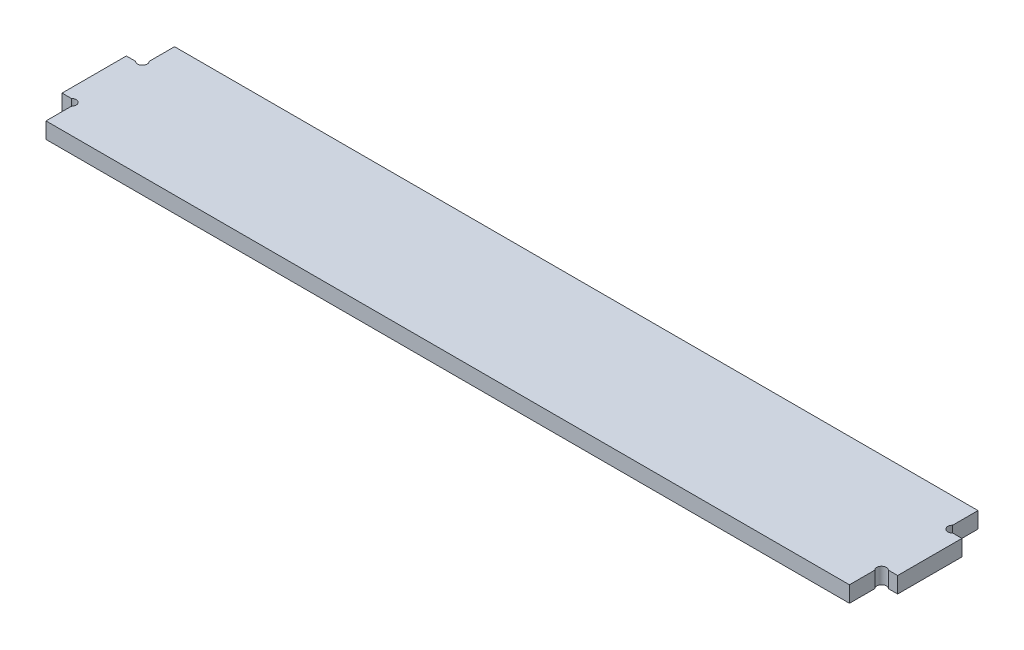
from build123d import *

# Parameters (mm, degrees)
CROQUIS1_W              = 500
CROQUIS1_H              = 10
SALIENTE_EXTRUIR1_DEPTH = 80
CROQUIS2_W              = 10
CROQUIS2_H              = 40
SALIENTE_EXTRUIR2_DEPTH = 10
CROQUIS3_R              = 3
CORTAR_EXTRUIR1_DEPTH   = 517.333225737


with BuildPart() as part:
    # Croquis1 → Saliente-Extruir1 (new body)
    with BuildSketch(Plane.XY):
        with Locations((-250, 168.639844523)):
            Rectangle(CROQUIS1_W, CROQUIS1_H)
    extrude(amount=SALIENTE_EXTRUIR1_DEPTH)

    # Croquis2 → Saliente-Extruir2 (add)
    with BuildSketch(Plane(origin=(0, 173.639844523, 0), x_dir=(1, 0, 0), z_dir=(0, 1, 0))):
        with Locations((-505, -40)):
            Rectangle(CROQUIS2_W, CROQUIS2_H)
    saliente_extruir2 = extrude(amount=-SALIENTE_EXTRUIR2_DEPTH)

    # Croquis3 → Cortar-Extruir1 (cut, through all)
    with BuildSketch(Plane(origin=(0, 173.639844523, 0), x_dir=(1, 0, 0), z_dir=(0, 1, 0))):
        with Locations((-502.121320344, -17.878679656)):
            Circle(CROQUIS3_R)
        with Locations((-502.121320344, -62.121320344)):
            Circle(CROQUIS3_R)
    cortar_extruir1 = extrude(amount=-CORTAR_EXTRUIR1_DEPTH, mode=Mode.SUBTRACT)

    # Simetr_a1: Saliente-Extruir2, Cortar-Extruir1 across plane
    add(saliente_extruir2.mirror(Plane.ZY.offset(250)))
    add(cortar_extruir1.mirror(Plane.ZY.offset(250)), mode=Mode.SUBTRACT)


solid = part.part
